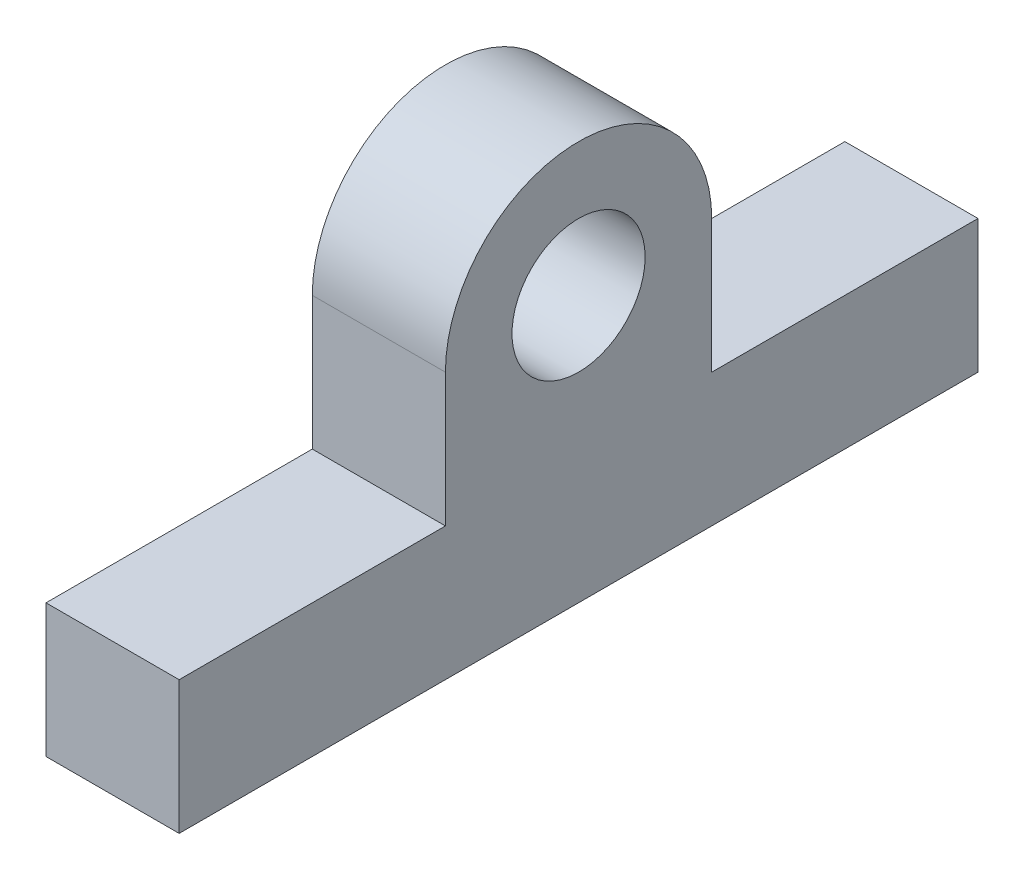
from build123d import *

# Parameters (mm, degrees)
BOSS_EXTRUDE1_DEPTH = 12.7
SKETCH2_R           = 6.35
CUT_EXTRUDE1_DEPTH  = 87.135590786
SKETCH3_R           = 1.27
CUT_EXTRUDE2_DEPTH  = 6.35


with BuildPart() as part:
    # Sketch1 → Boss-Extrude1 (new body)
    with BuildSketch(Plane(origin=(0, 0, 0), x_dir=(0, 0, -1), z_dir=(1, 0, 0))):
        with BuildLine():
            Line((0, 0), (76.2, 0))
            Line((76.2, 0), (76.2, 12.7))
            Line((76.2, 12.7), (50.8, 12.7))
            Line((50.8, 12.7), (50.8, 25.4))
            ThreePointArc((50.8, 25.4), (38.1, 38.1), (25.4, 25.4))
            Line((25.4, 25.4), (25.4, 12.7))
            Line((25.4, 12.7), (0, 12.7))
            Line((0, 12.7), (0, 0))
        make_face()
    extrude(amount=BOSS_EXTRUDE1_DEPTH)

    # Sketch2 → Cut-Extrude1 (cut, through all)
    with BuildSketch(Plane(origin=(12.7, 0, 0), x_dir=(0, 0, -1), z_dir=(1, 0, 0))):
        with Locations((38.1, 25.4)):
            Circle(SKETCH2_R)
    extrude(amount=-CUT_EXTRUDE1_DEPTH, mode=Mode.SUBTRACT)

    # Sketch3 → Cut-Extrude2 (cut)
    with BuildSketch(Plane.XZ):
        with Locations(Location((6.35, -12.7, 0), (0, 0, 270))):
            Circle(SKETCH3_R)
        with Locations(Location((6.35, -63.5, 0), (0, 0, 270))):
            Circle(SKETCH3_R)
    extrude(amount=-CUT_EXTRUDE2_DEPTH, mode=Mode.SUBTRACT)


solid = part.part
